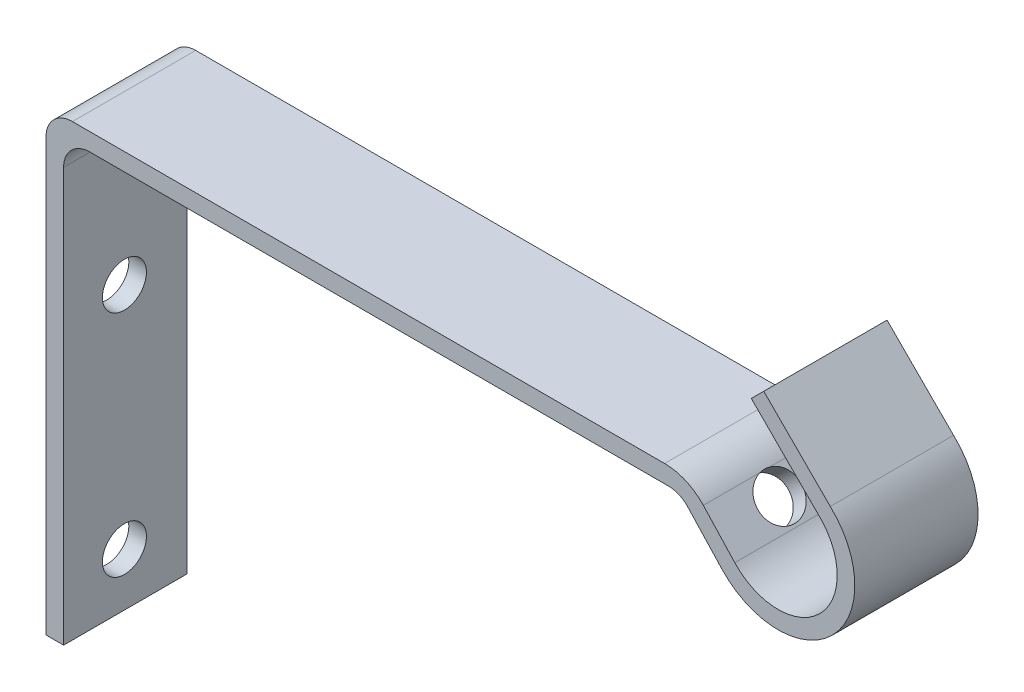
ISO-10303-21;
HEADER;
FILE_DESCRIPTION(('STEP AP214'),'2;1');
FILE_NAME('part.step','',(''),(''),'','','');
FILE_SCHEMA(('AUTOMOTIVE_DESIGN { 1 0 10303 214 1 1 1 1 }'));
ENDSEC;
DATA;
#1=APPLICATION_CONTEXT('core data for automotive mechanical design processes');
#2=APPLICATION_PROTOCOL_DEFINITION('international standard','automotive_design',2000,#1);
#3=PRODUCT_CONTEXT('',#1,'mechanical');
#4=PRODUCT('Part','Part','',(#3));
#5=PRODUCT_RELATED_PRODUCT_CATEGORY('part','',(#4));
#6=PRODUCT_DEFINITION_FORMATION('','',#4);
#7=PRODUCT_DEFINITION_CONTEXT('part definition',#1,'design');
#8=PRODUCT_DEFINITION('design','',#6,#7);
#9=PRODUCT_DEFINITION_SHAPE('','',#8);
#10=(LENGTH_UNIT() NAMED_UNIT(*) SI_UNIT(.MILLI.,.METRE.));
#11=(NAMED_UNIT(*) PLANE_ANGLE_UNIT() SI_UNIT($,.RADIAN.));
#12=(NAMED_UNIT(*) SI_UNIT($,.STERADIAN.) SOLID_ANGLE_UNIT());
#13=UNCERTAINTY_MEASURE_WITH_UNIT(LENGTH_MEASURE(1.E-05),#10,'distance_accuracy_value','');
#14=(GEOMETRIC_REPRESENTATION_CONTEXT(3) GLOBAL_UNCERTAINTY_ASSIGNED_CONTEXT((#13)) GLOBAL_UNIT_ASSIGNED_CONTEXT((#10,
#11,#12)) REPRESENTATION_CONTEXT('',''));
#15=CARTESIAN_POINT('',(0.,0.,0.));
#16=DIRECTION('',(0.,0.,1.));
#17=DIRECTION('',(1.,0.,0.));
#18=AXIS2_PLACEMENT_3D('',#15,#16,#17);
#19=CARTESIAN_POINT('',(-2.,0.,14.));
#20=DIRECTION('',(0.,1.,0.));
#21=DIRECTION('',(0.,0.,1.));
#22=AXIS2_PLACEMENT_3D('',#19,#20,#21);
#23=PLANE('',#22);
#24=DIRECTION('',(1.,0.,0.));
#25=VECTOR('',#24,1.);
#26=CARTESIAN_POINT('',(-2.,0.,0.));
#27=LINE('',#26,#25);
#28=CARTESIAN_POINT('',(-2.,0.,0.));
#29=VERTEX_POINT('',#28);
#30=CARTESIAN_POINT('',(0.,0.,0.));
#31=VERTEX_POINT('',#30);
#32=EDGE_CURVE('E180',#29,#31,#27,.T.);
#33=ORIENTED_EDGE('',*,*,#32,.T.);
#34=DIRECTION('',(0.,0.,-1.));
#35=VECTOR('',#34,1.);
#36=CARTESIAN_POINT('',(0.,0.,14.));
#37=LINE('',#36,#35);
#38=CARTESIAN_POINT('',(0.,0.,14.));
#39=VERTEX_POINT('',#38);
#40=EDGE_CURVE('E160',#39,#31,#37,.T.);
#41=ORIENTED_EDGE('',*,*,#40,.F.);
#42=DIRECTION('',(1.,0.,0.));
#43=VECTOR('',#42,1.);
#44=CARTESIAN_POINT('',(-2.,0.,14.));
#45=LINE('',#44,#43);
#46=CARTESIAN_POINT('',(-2.,0.,14.));
#47=VERTEX_POINT('',#46);
#48=EDGE_CURVE('E167',#47,#39,#45,.T.);
#49=ORIENTED_EDGE('',*,*,#48,.F.);
#50=DIRECTION('',(0.,0.,-1.));
#51=VECTOR('',#50,1.);
#52=CARTESIAN_POINT('',(-2.,0.,14.));
#53=LINE('',#52,#51);
#54=EDGE_CURVE('E489',#47,#29,#53,.T.);
#55=ORIENTED_EDGE('',*,*,#54,.T.);
#56=EDGE_LOOP('',(#33,#41,#49,#55));
#57=FACE_BOUND('',#56,.T.);
#58=ADVANCED_FACE('F36',(#57),#23,.F.);
#59=CARTESIAN_POINT('',(0.,0.,14.));
#60=DIRECTION('',(-1.,0.,0.));
#61=DIRECTION('',(0.,0.,1.));
#62=AXIS2_PLACEMENT_3D('',#59,#60,#61);
#63=PLANE('',#62);
#64=CARTESIAN_POINT('',(0.,32.,7.09326865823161));
#65=DIRECTION('',(1.,0.,0.));
#66=DIRECTION('',(0.,0.,-1.));
#67=AXIS2_PLACEMENT_3D('',#64,#65,#66);
#68=CIRCLE('',#67,2.5);
#69=CARTESIAN_POINT('',(0.,32.,4.59326865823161));
#70=VERTEX_POINT('',#69);
#71=EDGE_CURVE('E563',#70,#70,#68,.T.);
#72=ORIENTED_EDGE('',*,*,#71,.F.);
#73=EDGE_LOOP('',(#72));
#74=FACE_BOUND('',#73,.T.);
#75=CARTESIAN_POINT('',(0.,6.,7.09326865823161));
#76=DIRECTION('',(1.,0.,0.));
#77=DIRECTION('',(0.,0.,-1.));
#78=AXIS2_PLACEMENT_3D('',#75,#76,#77);
#79=CIRCLE('',#78,2.5);
#80=CARTESIAN_POINT('',(0.,6.,4.59326865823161));
#81=VERTEX_POINT('',#80);
#82=EDGE_CURVE('E569',#81,#81,#79,.T.);
#83=ORIENTED_EDGE('',*,*,#82,.F.);
#84=EDGE_LOOP('',(#83));
#85=FACE_BOUND('',#84,.T.);
#86=DIRECTION('',(0.,1.,0.));
#87=VECTOR('',#86,1.);
#88=CARTESIAN_POINT('',(0.,0.,0.));
#89=LINE('',#88,#87);
#90=CARTESIAN_POINT('',(0.,47.,0.));
#91=VERTEX_POINT('',#90);
#92=EDGE_CURVE('E491',#31,#91,#89,.T.);
#93=ORIENTED_EDGE('',*,*,#92,.T.);
#94=DIRECTION('',(0.,0.,-1.));
#95=VECTOR('',#94,1.);
#96=CARTESIAN_POINT('',(0.,47.,14.));
#97=LINE('',#96,#95);
#98=CARTESIAN_POINT('',(0.,47.,14.));
#99=VERTEX_POINT('',#98);
#100=EDGE_CURVE('E163',#91,#99,#97,.F.);
#101=ORIENTED_EDGE('',*,*,#100,.T.);
#102=DIRECTION('',(0.,1.,0.));
#103=VECTOR('',#102,1.);
#104=CARTESIAN_POINT('',(0.,0.,14.));
#105=LINE('',#104,#103);
#106=EDGE_CURVE('E155',#39,#99,#105,.T.);
#107=ORIENTED_EDGE('',*,*,#106,.F.);
#108=ORIENTED_EDGE('',*,*,#40,.T.);
#109=EDGE_LOOP('',(#93,#101,#107,#108));
#110=FACE_BOUND('',#109,.T.);
#111=ADVANCED_FACE('F158',(#74,#85,#110),#63,.F.);
#112=CARTESIAN_POINT('',(0.,50.,14.));
#113=DIRECTION('',(0.,1.,0.));
#114=DIRECTION('',(0.,0.,1.));
#115=AXIS2_PLACEMENT_3D('',#112,#113,#114);
#116=PLANE('',#115);
#117=DIRECTION('',(1.,0.,0.));
#118=VECTOR('',#117,1.);
#119=CARTESIAN_POINT('',(0.,50.,0.));
#120=LINE('',#119,#118);
#121=CARTESIAN_POINT('',(3.,50.,0.));
#122=VERTEX_POINT('',#121);
#123=CARTESIAN_POINT('',(68.6914366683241,50.,0.));
#124=VERTEX_POINT('',#123);
#125=EDGE_CURVE('E494',#122,#124,#120,.T.);
#126=ORIENTED_EDGE('',*,*,#125,.T.);
#127=DIRECTION('',(0.,0.,-1.));
#128=VECTOR('',#127,1.);
#129=CARTESIAN_POINT('',(68.6914366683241,50.,14.));
#130=LINE('',#129,#128);
#131=CARTESIAN_POINT('',(68.6914366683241,50.,14.));
#132=VERTEX_POINT('',#131);
#133=EDGE_CURVE('E57',#124,#132,#130,.F.);
#134=ORIENTED_EDGE('',*,*,#133,.T.);
#135=DIRECTION('',(1.,0.,0.));
#136=VECTOR('',#135,1.);
#137=CARTESIAN_POINT('',(0.,50.,14.));
#138=LINE('',#137,#136);
#139=CARTESIAN_POINT('',(3.,50.,14.));
#140=VERTEX_POINT('',#139);
#141=EDGE_CURVE('E166',#140,#132,#138,.T.);
#142=ORIENTED_EDGE('',*,*,#141,.F.);
#143=DIRECTION('',(0.,0.,-1.));
#144=VECTOR('',#143,1.);
#145=CARTESIAN_POINT('',(3.,50.,0.));
#146=LINE('',#145,#144);
#147=EDGE_CURVE('E208',#140,#122,#146,.T.);
#148=ORIENTED_EDGE('',*,*,#147,.T.);
#149=EDGE_LOOP('',(#126,#134,#142,#148));
#150=FACE_BOUND('',#149,.T.);
#151=ADVANCED_FACE('F283',(#150),#116,.F.);
#152=CARTESIAN_POINT('',(70.,50.,14.));
#153=DIRECTION('',(0.732928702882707,0.68030545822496,0.));
#154=DIRECTION('',(-0.68030545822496,0.732928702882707,0.));
#155=AXIS2_PLACEMENT_3D('',#152,#153,#154);
#156=PLANE('',#155);
#157=CARTESIAN_POINT('',(72.8462596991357,46.9335753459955,7.));
#158=DIRECTION('',(0.732928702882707,0.68030545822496,0.));
#159=DIRECTION('',(-0.68030545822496,0.732928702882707,0.));
#160=AXIS2_PLACEMENT_3D('',#157,#158,#159);
#161=CIRCLE('',#160,2.5);
#162=CARTESIAN_POINT('',(71.1454960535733,48.7658971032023,7.));
#163=VERTEX_POINT('',#162);
#164=EDGE_CURVE('E560',#163,#163,#161,.T.);
#165=ORIENTED_EDGE('',*,*,#164,.T.);
#166=EDGE_LOOP('',(#165));
#167=FACE_BOUND('',#166,.T.);
#168=DIRECTION('',(0.68030545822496,-0.732928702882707,0.));
#169=VECTOR('',#168,1.);
#170=CARTESIAN_POINT('',(70.,50.,14.));
#171=LINE('',#170,#169);
#172=CARTESIAN_POINT('',(70.8902227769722,49.0409163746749,14.));
#173=VERTEX_POINT('',#172);
#174=CARTESIAN_POINT('',(74.7621382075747,44.8694990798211,14.));
#175=VERTEX_POINT('',#174);
#176=EDGE_CURVE('E466',#173,#175,#171,.T.);
#177=ORIENTED_EDGE('',*,*,#176,.F.);
#178=DIRECTION('',(0.,0.,-1.));
#179=VECTOR('',#178,1.);
#180=CARTESIAN_POINT('',(70.8902227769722,49.0409163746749,0.));
#181=LINE('',#180,#179);
#182=CARTESIAN_POINT('',(70.8902227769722,49.0409163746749,0.));
#183=VERTEX_POINT('',#182);
#184=EDGE_CURVE('E223',#173,#183,#181,.T.);
#185=ORIENTED_EDGE('',*,*,#184,.T.);
#186=DIRECTION('',(0.68030545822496,-0.732928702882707,0.));
#187=VECTOR('',#186,1.);
#188=CARTESIAN_POINT('',(70.,50.,0.));
#189=LINE('',#188,#187);
#190=CARTESIAN_POINT('',(74.7621382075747,44.8694990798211,0.));
#191=VERTEX_POINT('',#190);
#192=EDGE_CURVE('E496',#183,#191,#189,.T.);
#193=ORIENTED_EDGE('',*,*,#192,.T.);
#194=DIRECTION('',(0.,0.,-1.));
#195=VECTOR('',#194,1.);
#196=CARTESIAN_POINT('',(74.7621382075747,44.8694990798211,14.));
#197=LINE('',#196,#195);
#198=EDGE_CURVE('E182',#175,#191,#197,.T.);
#199=ORIENTED_EDGE('',*,*,#198,.F.);
#200=EDGE_LOOP('',(#177,#185,#193,#199));
#201=FACE_BOUND('',#200,.T.);
#202=ADVANCED_FACE('F279',(#167,#201),#156,.F.);
#203=CARTESIAN_POINT('',(81.1470165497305,50.7959521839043,14.));
#204=DIRECTION('',(0.,0.,-1.));
#205=DIRECTION('',(-1.,0.,0.));
#206=AXIS2_PLACEMENT_3D('',#203,#204,#205);
#207=CYLINDRICAL_SURFACE('',#206,8.71145899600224);
#208=CARTESIAN_POINT('',(81.1470165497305,50.7959521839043,0.));
#209=DIRECTION('',(0.,0.,1.));
#210=DIRECTION('',(1.,0.,0.));
#211=AXIS2_PLACEMENT_3D('',#208,#209,#210);
#212=CIRCLE('',#211,8.71145899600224);
#213=CARTESIAN_POINT('',(87.0770242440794,57.177529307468,0.));
#214=VERTEX_POINT('',#213);
#215=EDGE_CURVE('E498',#191,#214,#212,.T.);
#216=ORIENTED_EDGE('',*,*,#215,.T.);
#217=DIRECTION('',(0.,0.,-1.));
#218=VECTOR('',#217,1.);
#219=CARTESIAN_POINT('',(87.0770242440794,57.177529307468,14.));
#220=LINE('',#219,#218);
#221=CARTESIAN_POINT('',(87.0770242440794,57.177529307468,14.));
#222=VERTEX_POINT('',#221);
#223=EDGE_CURVE('E188',#222,#214,#220,.T.);
#224=ORIENTED_EDGE('',*,*,#223,.F.);
#225=CARTESIAN_POINT('',(81.1470165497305,50.7959521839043,14.));
#226=DIRECTION('',(0.,0.,1.));
#227=DIRECTION('',(1.,0.,0.));
#228=AXIS2_PLACEMENT_3D('',#225,#226,#227);
#229=CIRCLE('',#228,8.71145899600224);
#230=EDGE_CURVE('E470',#175,#222,#229,.T.);
#231=ORIENTED_EDGE('',*,*,#230,.F.);
#232=ORIENTED_EDGE('',*,*,#198,.T.);
#233=EDGE_LOOP('',(#216,#224,#231,#232));
#234=FACE_BOUND('',#233,.T.);
#235=ADVANCED_FACE('F275',(#234),#207,.T.);
#236=CARTESIAN_POINT('',(87.0770242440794,57.177529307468,14.));
#237=DIRECTION('',(-0.707106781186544,-0.707106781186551,0.));
#238=DIRECTION('',(0.707106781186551,-0.707106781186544,0.));
#239=AXIS2_PLACEMENT_3D('',#236,#237,#238);
#240=PLANE('',#239);
#241=DIRECTION('',(-0.707106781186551,0.707106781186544,0.));
#242=VECTOR('',#241,1.);
#243=CARTESIAN_POINT('',(87.0770242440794,57.177529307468,0.));
#244=LINE('',#243,#242);
#245=CARTESIAN_POINT('',(79.5201694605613,64.734384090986,0.));
#246=VERTEX_POINT('',#245);
#247=EDGE_CURVE('E500',#214,#246,#244,.T.);
#248=ORIENTED_EDGE('',*,*,#247,.T.);
#249=DIRECTION('',(0.,0.,-1.));
#250=VECTOR('',#249,1.);
#251=CARTESIAN_POINT('',(79.5201694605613,64.734384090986,14.));
#252=LINE('',#251,#250);
#253=CARTESIAN_POINT('',(79.5201694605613,64.734384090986,14.));
#254=VERTEX_POINT('',#253);
#255=EDGE_CURVE('E526',#254,#246,#252,.T.);
#256=ORIENTED_EDGE('',*,*,#255,.F.);
#257=DIRECTION('',(-0.707106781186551,0.707106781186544,0.));
#258=VECTOR('',#257,1.);
#259=CARTESIAN_POINT('',(87.0770242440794,57.177529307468,14.));
#260=LINE('',#259,#258);
#261=EDGE_CURVE('E472',#222,#254,#260,.T.);
#262=ORIENTED_EDGE('',*,*,#261,.F.);
#263=ORIENTED_EDGE('',*,*,#223,.T.);
#264=EDGE_LOOP('',(#248,#256,#262,#263));
#265=FACE_BOUND('',#264,.T.);
#266=ADVANCED_FACE('F271',(#265),#240,.F.);
#267=CARTESIAN_POINT('',(79.5201694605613,64.734384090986,14.));
#268=DIRECTION('',(0.707106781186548,-0.707106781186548,0.));
#269=DIRECTION('',(0.707106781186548,0.707106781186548,0.));
#270=AXIS2_PLACEMENT_3D('',#267,#268,#269);
#271=PLANE('',#270);
#272=DIRECTION('',(-0.707106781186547,-0.707106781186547,0.));
#273=VECTOR('',#272,1.);
#274=CARTESIAN_POINT('',(79.5201694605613,64.734384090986,0.));
#275=LINE('',#274,#273);
#276=CARTESIAN_POINT('',(78.1059558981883,63.3201705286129,0.));
#277=VERTEX_POINT('',#276);
#278=EDGE_CURVE('E502',#246,#277,#275,.T.);
#279=ORIENTED_EDGE('',*,*,#278,.T.);
#280=DIRECTION('',(0.,0.,-1.));
#281=VECTOR('',#280,1.);
#282=CARTESIAN_POINT('',(78.1059558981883,63.3201705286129,14.));
#283=LINE('',#282,#281);
#284=CARTESIAN_POINT('',(78.1059558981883,63.3201705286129,14.));
#285=VERTEX_POINT('',#284);
#286=EDGE_CURVE('E523',#285,#277,#283,.T.);
#287=ORIENTED_EDGE('',*,*,#286,.F.);
#288=DIRECTION('',(-0.707106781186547,-0.707106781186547,0.));
#289=VECTOR('',#288,1.);
#290=CARTESIAN_POINT('',(79.5201694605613,64.734384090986,14.));
#291=LINE('',#290,#289);
#292=EDGE_CURVE('E477',#254,#285,#291,.T.);
#293=ORIENTED_EDGE('',*,*,#292,.F.);
#294=ORIENTED_EDGE('',*,*,#255,.T.);
#295=EDGE_LOOP('',(#279,#287,#293,#294));
#296=FACE_BOUND('',#295,.T.);
#297=ADVANCED_FACE('F267',(#296),#271,.F.);
#298=CARTESIAN_POINT('',(85.690426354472,55.7357000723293,14.));
#299=DIRECTION('',(0.707106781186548,0.707106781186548,0.));
#300=DIRECTION('',(-0.707106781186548,0.707106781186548,0.));
#301=AXIS2_PLACEMENT_3D('',#298,#299,#300);
#302=PLANE('',#301);
#303=DIRECTION('',(0.707106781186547,-0.707106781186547,0.));
#304=VECTOR('',#303,1.);
#305=CARTESIAN_POINT('',(85.690426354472,55.7357000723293,0.));
#306=LINE('',#305,#304);
#307=CARTESIAN_POINT('',(85.690426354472,55.7357000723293,0.));
#308=VERTEX_POINT('',#307);
#309=EDGE_CURVE('E504',#277,#308,#306,.T.);
#310=ORIENTED_EDGE('',*,*,#309,.T.);
#311=DIRECTION('',(0.,0.,-1.));
#312=VECTOR('',#311,1.);
#313=CARTESIAN_POINT('',(85.690426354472,55.7357000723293,14.));
#314=LINE('',#313,#312);
#315=CARTESIAN_POINT('',(85.690426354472,55.7357000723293,14.));
#316=VERTEX_POINT('',#315);
#317=EDGE_CURVE('E520',#316,#308,#314,.T.);
#318=ORIENTED_EDGE('',*,*,#317,.F.);
#319=DIRECTION('',(0.707106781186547,-0.707106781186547,0.));
#320=VECTOR('',#319,1.);
#321=CARTESIAN_POINT('',(85.690426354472,55.7357000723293,14.));
#322=LINE('',#321,#320);
#323=EDGE_CURVE('E479',#285,#316,#322,.T.);
#324=ORIENTED_EDGE('',*,*,#323,.F.);
#325=ORIENTED_EDGE('',*,*,#286,.T.);
#326=EDGE_LOOP('',(#310,#318,#324,#325));
#327=FACE_BOUND('',#326,.T.);
#328=ADVANCED_FACE('F263',(#327),#302,.F.);
#329=CARTESIAN_POINT('',(81.1470165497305,50.7959521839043,14.));
#330=DIRECTION('',(0.,0.,-1.));
#331=DIRECTION('',(-1.,0.,0.));
#332=AXIS2_PLACEMENT_3D('',#329,#330,#331);
#333=CYLINDRICAL_SURFACE('',#332,6.71145899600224);
#334=CARTESIAN_POINT('',(81.1470165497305,50.7959521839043,0.));
#335=DIRECTION('',(0.,0.,-1.));
#336=DIRECTION('',(1.,0.,0.));
#337=AXIS2_PLACEMENT_3D('',#334,#335,#336);
#338=CIRCLE('',#337,6.71145899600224);
#339=CARTESIAN_POINT('',(76.2279956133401,46.230109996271,0.));
#340=VERTEX_POINT('',#339);
#341=EDGE_CURVE('E506',#308,#340,#338,.T.);
#342=ORIENTED_EDGE('',*,*,#341,.T.);
#343=DIRECTION('',(0.,0.,-1.));
#344=VECTOR('',#343,1.);
#345=CARTESIAN_POINT('',(76.2279956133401,46.230109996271,14.));
#346=LINE('',#345,#344);
#347=CARTESIAN_POINT('',(76.2279956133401,46.230109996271,14.));
#348=VERTEX_POINT('',#347);
#349=EDGE_CURVE('E517',#348,#340,#346,.T.);
#350=ORIENTED_EDGE('',*,*,#349,.F.);
#351=CARTESIAN_POINT('',(81.1470165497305,50.7959521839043,14.));
#352=DIRECTION('',(0.,0.,-1.));
#353=DIRECTION('',(1.,0.,0.));
#354=AXIS2_PLACEMENT_3D('',#351,#352,#353);
#355=CIRCLE('',#354,6.71145899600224);
#356=EDGE_CURVE('E481',#316,#348,#355,.T.);
#357=ORIENTED_EDGE('',*,*,#356,.F.);
#358=ORIENTED_EDGE('',*,*,#317,.T.);
#359=EDGE_LOOP('',(#342,#350,#357,#358));
#360=FACE_BOUND('',#359,.T.);
#361=ADVANCED_FACE('F259',(#360),#333,.F.);
#362=CARTESIAN_POINT('',(71.4658574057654,51.3606109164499,14.));
#363=DIRECTION('',(-0.732928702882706,-0.680305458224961,0.));
#364=DIRECTION('',(0.680305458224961,-0.732928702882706,0.));
#365=AXIS2_PLACEMENT_3D('',#362,#363,#364);
#366=PLANE('',#365);
#367=DIRECTION('',(0.,0.,-1.));
#368=VECTOR('',#367,1.);
#369=CARTESIAN_POINT('',(72.652821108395,50.0818327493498,14.));
#370=LINE('',#369,#368);
#371=CARTESIAN_POINT('',(72.652821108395,50.0818327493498,0.));
#372=VERTEX_POINT('',#371);
#373=CARTESIAN_POINT('',(72.652821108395,50.0818327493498,6.45131353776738));
#374=VERTEX_POINT('',#373);
#375=EDGE_CURVE('E194',#372,#374,#370,.F.);
#376=ORIENTED_EDGE('',*,*,#375,.T.);
#377=CARTESIAN_POINT('',(74.3121171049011,48.2941862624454,7.));
#378=DIRECTION('',(0.732928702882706,0.680305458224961,0.));
#379=DIRECTION('',(-0.680305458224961,0.732928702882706,0.));
#380=AXIS2_PLACEMENT_3D('',#377,#378,#379);
#381=CIRCLE('',#380,2.5);
#382=CARTESIAN_POINT('',(72.652821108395,50.0818327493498,7.54868646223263));
#383=VERTEX_POINT('',#382);
#384=EDGE_CURVE('E548',#383,#374,#381,.T.);
#385=ORIENTED_EDGE('',*,*,#384,.F.);
#386=CARTESIAN_POINT('',(72.652821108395,50.0818327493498,14.));
#387=VERTEX_POINT('',#386);
#388=EDGE_CURVE('E193',#383,#387,#370,.F.);
#389=ORIENTED_EDGE('',*,*,#388,.T.);
#390=DIRECTION('',(-0.68030545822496,0.732928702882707,0.));
#391=VECTOR('',#390,1.);
#392=CARTESIAN_POINT('',(71.4658574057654,51.3606109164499,14.));
#393=LINE('',#392,#391);
#394=EDGE_CURVE('E483',#348,#387,#393,.T.);
#395=ORIENTED_EDGE('',*,*,#394,.F.);
#396=ORIENTED_EDGE('',*,*,#349,.T.);
#397=DIRECTION('',(-0.680305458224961,0.732928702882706,0.));
#398=VECTOR('',#397,1.);
#399=CARTESIAN_POINT('',(71.4658574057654,51.3606109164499,0.));
#400=LINE('',#399,#398);
#401=EDGE_CURVE('E509',#340,#372,#400,.T.);
#402=ORIENTED_EDGE('',*,*,#401,.T.);
#403=EDGE_LOOP('',(#376,#385,#389,#395,#396,#402));
#404=FACE_BOUND('',#403,.T.);
#405=ADVANCED_FACE('F255',(#404),#366,.F.);
#406=CARTESIAN_POINT('',(-2.,52.,14.));
#407=DIRECTION('',(0.,-1.,0.));
#408=DIRECTION('',(0.,0.,-1.));
#409=AXIS2_PLACEMENT_3D('',#406,#407,#408);
#410=PLANE('',#409);
#411=DIRECTION('',(-1.,0.,0.));
#412=VECTOR('',#411,1.);
#413=CARTESIAN_POINT('',(-2.,52.,0.));
#414=LINE('',#413,#412);
#415=CARTESIAN_POINT('',(68.2552488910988,52.,0.));
#416=VERTEX_POINT('',#415);
#417=CARTESIAN_POINT('',(1.,52.,0.));
#418=VERTEX_POINT('',#417);
#419=EDGE_CURVE('E512',#416,#418,#414,.T.);
#420=ORIENTED_EDGE('',*,*,#419,.T.);
#421=DIRECTION('',(0.,0.,-1.));
#422=VECTOR('',#421,1.);
#423=CARTESIAN_POINT('',(1.,52.,14.));
#424=LINE('',#423,#422);
#425=CARTESIAN_POINT('',(1.,52.,14.));
#426=VERTEX_POINT('',#425);
#427=EDGE_CURVE('E204',#418,#426,#424,.F.);
#428=ORIENTED_EDGE('',*,*,#427,.T.);
#429=DIRECTION('',(-1.,0.,0.));
#430=VECTOR('',#429,1.);
#431=CARTESIAN_POINT('',(70.,52.,14.));
#432=LINE('',#431,#430);
#433=CARTESIAN_POINT('',(68.2552488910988,52.,14.));
#434=VERTEX_POINT('',#433);
#435=EDGE_CURVE('E486',#434,#426,#432,.T.);
#436=ORIENTED_EDGE('',*,*,#435,.F.);
#437=DIRECTION('',(0.,0.,-1.));
#438=VECTOR('',#437,1.);
#439=CARTESIAN_POINT('',(68.2552488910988,52.,14.));
#440=LINE('',#439,#438);
#441=EDGE_CURVE('E181',#434,#416,#440,.T.);
#442=ORIENTED_EDGE('',*,*,#441,.T.);
#443=EDGE_LOOP('',(#420,#428,#436,#442));
#444=FACE_BOUND('',#443,.T.);
#445=ADVANCED_FACE('F251',(#444),#410,.F.);
#446=CARTESIAN_POINT('',(-2.,0.,14.));
#447=DIRECTION('',(1.,0.,0.));
#448=DIRECTION('',(0.,0.,-1.));
#449=AXIS2_PLACEMENT_3D('',#446,#447,#448);
#450=PLANE('',#449);
#451=CARTESIAN_POINT('',(-2.,32.,7.09326865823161));
#452=DIRECTION('',(1.,0.,0.));
#453=DIRECTION('',(0.,0.,-1.));
#454=AXIS2_PLACEMENT_3D('',#451,#452,#453);
#455=CIRCLE('',#454,2.5);
#456=CARTESIAN_POINT('',(-2.,32.,4.59326865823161));
#457=VERTEX_POINT('',#456);
#458=EDGE_CURVE('E566',#457,#457,#455,.T.);
#459=ORIENTED_EDGE('',*,*,#458,.T.);
#460=EDGE_LOOP('',(#459));
#461=FACE_BOUND('',#460,.T.);
#462=CARTESIAN_POINT('',(-2.,6.,7.09326865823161));
#463=DIRECTION('',(1.,0.,0.));
#464=DIRECTION('',(0.,0.,-1.));
#465=AXIS2_PLACEMENT_3D('',#462,#463,#464);
#466=CIRCLE('',#465,2.5);
#467=CARTESIAN_POINT('',(-2.,6.,4.59326865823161));
#468=VERTEX_POINT('',#467);
#469=EDGE_CURVE('E492',#468,#468,#466,.T.);
#470=ORIENTED_EDGE('',*,*,#469,.T.);
#471=EDGE_LOOP('',(#470));
#472=FACE_BOUND('',#471,.T.);
#473=DIRECTION('',(0.,-1.,0.));
#474=VECTOR('',#473,1.);
#475=CARTESIAN_POINT('',(-2.,0.,14.));
#476=LINE('',#475,#474);
#477=CARTESIAN_POINT('',(-2.,49.,14.));
#478=VERTEX_POINT('',#477);
#479=EDGE_CURVE('E173',#478,#47,#476,.T.);
#480=ORIENTED_EDGE('',*,*,#479,.F.);
#481=DIRECTION('',(0.,0.,-1.));
#482=VECTOR('',#481,1.);
#483=CARTESIAN_POINT('',(-2.,49.,14.));
#484=LINE('',#483,#482);
#485=CARTESIAN_POINT('',(-2.,49.,0.));
#486=VERTEX_POINT('',#485);
#487=EDGE_CURVE('E199',#478,#486,#484,.T.);
#488=ORIENTED_EDGE('',*,*,#487,.T.);
#489=DIRECTION('',(0.,-1.,0.));
#490=VECTOR('',#489,1.);
#491=CARTESIAN_POINT('',(-2.,0.,0.));
#492=LINE('',#491,#490);
#493=EDGE_CURVE('E177',#486,#29,#492,.T.);
#494=ORIENTED_EDGE('',*,*,#493,.T.);
#495=ORIENTED_EDGE('',*,*,#54,.F.);
#496=EDGE_LOOP('',(#480,#488,#494,#495));
#497=FACE_BOUND('',#496,.T.);
#498=ADVANCED_FACE('F246',(#461,#472,#497),#450,.F.);
#499=CARTESIAN_POINT('',(81.1470165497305,50.7959521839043,14.));
#500=DIRECTION('',(0.,0.,1.));
#501=DIRECTION('',(1.,0.,0.));
#502=AXIS2_PLACEMENT_3D('',#499,#500,#501);
#503=PLANE('',#502);
#504=ORIENTED_EDGE('',*,*,#435,.T.);
#505=CARTESIAN_POINT('',(1.,49.,14.));
#506=DIRECTION('',(0.,0.,1.));
#507=DIRECTION('',(1.,0.,0.));
#508=AXIS2_PLACEMENT_3D('',#505,#506,#507);
#509=CIRCLE('',#508,3.);
#510=EDGE_CURVE('E206',#426,#478,#509,.T.);
#511=ORIENTED_EDGE('',*,*,#510,.T.);
#512=ORIENTED_EDGE('',*,*,#479,.T.);
#513=ORIENTED_EDGE('',*,*,#48,.T.);
#514=ORIENTED_EDGE('',*,*,#106,.T.);
#515=CARTESIAN_POINT('',(3.,47.,14.));
#516=DIRECTION('',(0.,0.,1.));
#517=DIRECTION('',(1.,0.,0.));
#518=AXIS2_PLACEMENT_3D('',#515,#516,#517);
#519=CIRCLE('',#518,3.);
#520=EDGE_CURVE('E214',#99,#140,#519,.F.);
#521=ORIENTED_EDGE('',*,*,#520,.T.);
#522=ORIENTED_EDGE('',*,*,#141,.T.);
#523=CARTESIAN_POINT('',(68.6914366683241,47.,14.));
#524=DIRECTION('',(0.,0.,1.));
#525=DIRECTION('',(1.,0.,0.));
#526=AXIS2_PLACEMENT_3D('',#523,#524,#525);
#527=CIRCLE('',#526,3.);
#528=EDGE_CURVE('E11',#132,#173,#527,.F.);
#529=ORIENTED_EDGE('',*,*,#528,.T.);
#530=ORIENTED_EDGE('',*,*,#176,.T.);
#531=ORIENTED_EDGE('',*,*,#230,.T.);
#532=ORIENTED_EDGE('',*,*,#261,.T.);
#533=ORIENTED_EDGE('',*,*,#292,.T.);
#534=ORIENTED_EDGE('',*,*,#323,.T.);
#535=ORIENTED_EDGE('',*,*,#356,.T.);
#536=ORIENTED_EDGE('',*,*,#394,.T.);
#537=CARTESIAN_POINT('',(68.2552488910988,46.,14.));
#538=DIRECTION('',(0.,0.,1.));
#539=DIRECTION('',(1.,0.,0.));
#540=AXIS2_PLACEMENT_3D('',#537,#538,#539);
#541=CIRCLE('',#540,6.);
#542=EDGE_CURVE('E197',#387,#434,#541,.T.);
#543=ORIENTED_EDGE('',*,*,#542,.T.);
#544=EDGE_LOOP('',(#504,#511,#512,#513,#514,#521,#522,#529,#530,#531,#532,#533,#534,#535,#536,#543));
#545=FACE_BOUND('',#544,.T.);
#546=ADVANCED_FACE('F171',(#545),#503,.T.);
#547=CARTESIAN_POINT('',(81.1470165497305,50.7959521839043,0.));
#548=DIRECTION('',(0.,0.,1.));
#549=DIRECTION('',(1.,0.,0.));
#550=AXIS2_PLACEMENT_3D('',#547,#548,#549);
#551=PLANE('',#550);
#552=ORIENTED_EDGE('',*,*,#493,.F.);
#553=CARTESIAN_POINT('',(1.,49.,0.));
#554=DIRECTION('',(0.,0.,1.));
#555=DIRECTION('',(1.,0.,0.));
#556=AXIS2_PLACEMENT_3D('',#553,#554,#555);
#557=CIRCLE('',#556,3.);
#558=EDGE_CURVE('E202',#486,#418,#557,.F.);
#559=ORIENTED_EDGE('',*,*,#558,.T.);
#560=ORIENTED_EDGE('',*,*,#419,.F.);
#561=CARTESIAN_POINT('',(68.2552488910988,46.,0.));
#562=DIRECTION('',(0.,0.,1.));
#563=DIRECTION('',(1.,0.,0.));
#564=AXIS2_PLACEMENT_3D('',#561,#562,#563);
#565=CIRCLE('',#564,6.);
#566=EDGE_CURVE('E185',#416,#372,#565,.F.);
#567=ORIENTED_EDGE('',*,*,#566,.T.);
#568=ORIENTED_EDGE('',*,*,#401,.F.);
#569=ORIENTED_EDGE('',*,*,#341,.F.);
#570=ORIENTED_EDGE('',*,*,#309,.F.);
#571=ORIENTED_EDGE('',*,*,#278,.F.);
#572=ORIENTED_EDGE('',*,*,#247,.F.);
#573=ORIENTED_EDGE('',*,*,#215,.F.);
#574=ORIENTED_EDGE('',*,*,#192,.F.);
#575=CARTESIAN_POINT('',(68.6914366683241,47.,0.));
#576=DIRECTION('',(0.,0.,1.));
#577=DIRECTION('',(1.,0.,0.));
#578=AXIS2_PLACEMENT_3D('',#575,#576,#577);
#579=CIRCLE('',#578,3.);
#580=EDGE_CURVE('E44',#183,#124,#579,.T.);
#581=ORIENTED_EDGE('',*,*,#580,.T.);
#582=ORIENTED_EDGE('',*,*,#125,.F.);
#583=CARTESIAN_POINT('',(3.,47.,0.));
#584=DIRECTION('',(0.,0.,1.));
#585=DIRECTION('',(1.,0.,0.));
#586=AXIS2_PLACEMENT_3D('',#583,#584,#585);
#587=CIRCLE('',#586,3.);
#588=EDGE_CURVE('E212',#122,#91,#587,.T.);
#589=ORIENTED_EDGE('',*,*,#588,.T.);
#590=ORIENTED_EDGE('',*,*,#92,.F.);
#591=ORIENTED_EDGE('',*,*,#32,.F.);
#592=EDGE_LOOP('',(#552,#559,#560,#567,#568,#569,#570,#571,#572,#573,#574,#581,#582,#589,#590,#591));
#593=FACE_BOUND('',#592,.T.);
#594=ADVANCED_FACE('F245',(#593),#551,.F.);
#595=CARTESIAN_POINT('',(68.2552488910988,46.,14.));
#596=DIRECTION('',(0.,0.,-1.));
#597=DIRECTION('',(-1.,0.,0.));
#598=AXIS2_PLACEMENT_3D('',#595,#596,#597);
#599=CYLINDRICAL_SURFACE('',#598,6.);
#600=CARTESIAN_POINT('',(72.652821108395,50.0818327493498,6.45131353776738));
#601=CARTESIAN_POINT('',(72.6422201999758,50.0932397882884,6.52049960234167));
#602=CARTESIAN_POINT('',(72.6336016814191,50.1024491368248,6.59035164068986));
#603=CARTESIAN_POINT('',(72.620417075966,50.1164827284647,6.73090928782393));
#604=CARTESIAN_POINT('',(72.6158529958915,50.1213048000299,6.80161530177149));
#605=CARTESIAN_POINT('',(72.610920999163,50.1265148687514,6.94204011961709));
#606=CARTESIAN_POINT('',(72.6104780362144,50.1269821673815,7.01175339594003));
#607=CARTESIAN_POINT('',(72.6135960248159,50.1236898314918,7.1509545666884));
#608=CARTESIAN_POINT('',(72.6171545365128,50.1199327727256,7.22044257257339));
#609=CARTESIAN_POINT('',(72.6261536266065,50.1103790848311,7.33298924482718));
#610=CARTESIAN_POINT('',(72.630400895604,50.1058618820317,7.37625947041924));
#611=CARTESIAN_POINT('',(72.640448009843,50.0951287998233,7.46266670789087));
#612=CARTESIAN_POINT('',(72.6462567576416,50.0889031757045,7.5058014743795));
#613=CARTESIAN_POINT('',(72.652821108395,50.0818327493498,7.54868646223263));
#614=B_SPLINE_CURVE_WITH_KNOTS('',3,(#600,#601,#602,#603,#604,#605,#606,#607,#608,#609,#610,
#611,#612,#613),.UNSPECIFIED.,.F.,.F.,(4,2,2,2,2,2,4),(0.,0.21268746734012,0.425480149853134,
0.634390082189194,0.843172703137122,0.974254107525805,1.10609931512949),.UNSPECIFIED.);
#615=EDGE_CURVE('E216',#374,#383,#614,.T.);
#616=ORIENTED_EDGE('',*,*,#615,.F.);
#617=ORIENTED_EDGE('',*,*,#375,.F.);
#618=ORIENTED_EDGE('',*,*,#566,.F.);
#619=ORIENTED_EDGE('',*,*,#441,.F.);
#620=ORIENTED_EDGE('',*,*,#542,.F.);
#621=ORIENTED_EDGE('',*,*,#388,.F.);
#622=EDGE_LOOP('',(#616,#617,#618,#619,#620,#621));
#623=FACE_BOUND('',#622,.T.);
#624=ADVANCED_FACE('F225',(#623),#599,.T.);
#625=CARTESIAN_POINT('',(1.,49.,14.));
#626=DIRECTION('',(0.,0.,-1.));
#627=DIRECTION('',(-1.,0.,0.));
#628=AXIS2_PLACEMENT_3D('',#625,#626,#627);
#629=CYLINDRICAL_SURFACE('',#628,3.);
#630=ORIENTED_EDGE('',*,*,#510,.F.);
#631=ORIENTED_EDGE('',*,*,#427,.F.);
#632=ORIENTED_EDGE('',*,*,#558,.F.);
#633=ORIENTED_EDGE('',*,*,#487,.F.);
#634=EDGE_LOOP('',(#630,#631,#632,#633));
#635=FACE_BOUND('',#634,.T.);
#636=ADVANCED_FACE('F340',(#635),#629,.T.);
#637=CARTESIAN_POINT('',(3.,47.,14.));
#638=DIRECTION('',(0.,0.,1.));
#639=DIRECTION('',(1.,0.,0.));
#640=AXIS2_PLACEMENT_3D('',#637,#638,#639);
#641=CYLINDRICAL_SURFACE('',#640,3.);
#642=ORIENTED_EDGE('',*,*,#520,.F.);
#643=ORIENTED_EDGE('',*,*,#100,.F.);
#644=ORIENTED_EDGE('',*,*,#588,.F.);
#645=ORIENTED_EDGE('',*,*,#147,.F.);
#646=EDGE_LOOP('',(#642,#643,#644,#645));
#647=FACE_BOUND('',#646,.T.);
#648=ADVANCED_FACE('F241',(#647),#641,.F.);
#649=CARTESIAN_POINT('',(-2.,6.,7.09326865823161));
#650=DIRECTION('',(1.,0.,0.));
#651=DIRECTION('',(0.,0.,-1.));
#652=AXIS2_PLACEMENT_3D('',#649,#650,#651);
#653=CYLINDRICAL_SURFACE('',#652,2.5);
#654=ORIENTED_EDGE('',*,*,#469,.F.);
#655=EDGE_LOOP('',(#654));
#656=FACE_BOUND('',#655,.T.);
#657=ORIENTED_EDGE('',*,*,#82,.T.);
#658=EDGE_LOOP('',(#657));
#659=FACE_BOUND('',#658,.T.);
#660=ADVANCED_FACE('F237',(#656,#659),#653,.F.);
#661=CARTESIAN_POINT('',(-2.,32.,7.09326865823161));
#662=DIRECTION('',(1.,0.,0.));
#663=DIRECTION('',(0.,0.,-1.));
#664=AXIS2_PLACEMENT_3D('',#661,#662,#663);
#665=CYLINDRICAL_SURFACE('',#664,2.5);
#666=ORIENTED_EDGE('',*,*,#458,.F.);
#667=EDGE_LOOP('',(#666));
#668=FACE_BOUND('',#667,.T.);
#669=ORIENTED_EDGE('',*,*,#71,.T.);
#670=EDGE_LOOP('',(#669));
#671=FACE_BOUND('',#670,.T.);
#672=ADVANCED_FACE('F233',(#668,#671),#665,.F.);
#673=CARTESIAN_POINT('',(9.23820703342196,-12.1075090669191,7.));
#674=DIRECTION('',(0.732928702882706,0.680305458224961,0.));
#675=DIRECTION('',(-0.680305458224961,0.732928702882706,0.));
#676=AXIS2_PLACEMENT_3D('',#673,#674,#675);
#677=CYLINDRICAL_SURFACE('',#676,2.5);
#678=ORIENTED_EDGE('',*,*,#615,.T.);
#679=ORIENTED_EDGE('',*,*,#384,.T.);
#680=EDGE_LOOP('',(#678,#679));
#681=FACE_BOUND('',#680,.T.);
#682=ORIENTED_EDGE('',*,*,#164,.F.);
#683=EDGE_LOOP('',(#682));
#684=FACE_BOUND('',#683,.T.);
#685=ADVANCED_FACE('F229',(#681,#684),#677,.F.);
#686=CARTESIAN_POINT('',(68.6914366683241,47.,14.));
#687=DIRECTION('',(0.,0.,1.));
#688=DIRECTION('',(1.,0.,0.));
#689=AXIS2_PLACEMENT_3D('',#686,#687,#688);
#690=CYLINDRICAL_SURFACE('',#689,3.);
#691=ORIENTED_EDGE('',*,*,#528,.F.);
#692=ORIENTED_EDGE('',*,*,#133,.F.);
#693=ORIENTED_EDGE('',*,*,#580,.F.);
#694=ORIENTED_EDGE('',*,*,#184,.F.);
#695=EDGE_LOOP('',(#691,#692,#693,#694));
#696=FACE_BOUND('',#695,.T.);
#697=ADVANCED_FACE('F38',(#696),#690,.F.);
#698=CLOSED_SHELL('',(#58,#111,#151,#202,#235,#266,#297,#328,#361,#405,#445,#498,#546,#594,#624,
#636,#648,#660,#672,#685,#697));
#699=MANIFOLD_SOLID_BREP('B2',#698);
#700=ADVANCED_BREP_SHAPE_REPRESENTATION('',(#18,#699),#14);
#701=SHAPE_DEFINITION_REPRESENTATION(#9,#700);
ENDSEC;
END-ISO-10303-21;
